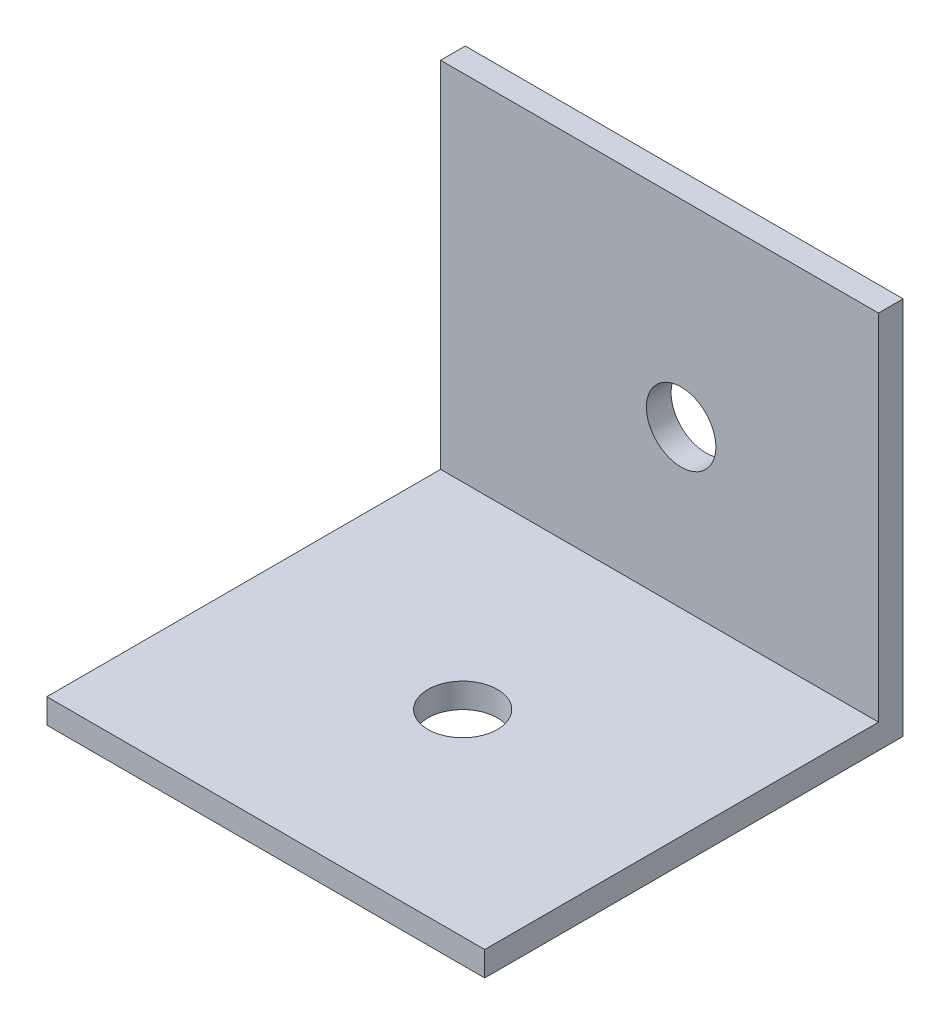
from build123d import *

# Parameters (mm, degrees)
SKETCH1_W           = 406.4
SKETCH1_H           = 24.384
BOSS_EXTRUDE1_DEPTH = 26.924
SKETCH2_W           = 406.4
SKETCH2_H           = 25.3365
CUT_EXTRUDE1_DEPTH  = 12.7
SKETCH3_W           = 406.4
SKETCH3_H           = 10.0965
CUT_EXTRUDE3_DEPTH  = 25.3365
SKETCH5_R           = 2.23393
CUT_EXTRUDE5_DEPTH  = 2.54
SKETCH6_W           = 409.302892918
SKETCH6_H           = 164.68100055
CUT_EXTRUDE6_DEPTH  = 65.024
SKETCH7_R           = 2.23393
CUT_EXTRUDE7_DEPTH  = 2.54


with BuildPart() as part:
    # Sketch1 → Boss-Extrude1 (new body)
    with BuildSketch(Plane.XY):
        with Locations((-6.626086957, 55.646509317)):
            Rectangle(SKETCH1_W, SKETCH1_H)
    extrude(amount=BOSS_EXTRUDE1_DEPTH)

    # Sketch2 → Cut-Extrude1 (cut)
    with BuildSketch(Plane(origin=(0, 67.838509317, 0), x_dir=(1, 0, 0), z_dir=(0, 1, 0))):
        with Locations((-6.626086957, -14.25575)):
            Rectangle(SKETCH2_W, SKETCH2_H)
    extrude(amount=-CUT_EXTRUDE1_DEPTH, mode=Mode.SUBTRACT)

    # Sketch3 → Cut-Extrude3 (cut)
    with BuildSketch(Plane.XY.offset(26.924)):
        with Locations((-6.626086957, 50.090259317)):
            Rectangle(SKETCH3_W, SKETCH3_H)
    extrude(amount=-CUT_EXTRUDE3_DEPTH, mode=Mode.SUBTRACT)

    # Sketch5 → Cut-Extrude5 (cut)
    with BuildSketch(Plane(origin=(0, 0, 0), x_dir=(-1, 0, 0), z_dir=(0, 0, -1))):
        with Locations((-183.873913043, 55.138509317)):
            Circle(SKETCH5_R)
        with Locations((197.126086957, 55.138509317)):
            Circle(SKETCH5_R)
    extrude(amount=-CUT_EXTRUDE5_DEPTH, mode=Mode.SUBTRACT)

    # Sketch6 → Cut-Extrude6 (cut)
    with BuildSketch(Plane.XZ.offset(-43.454509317)):
        with Locations((-36.252167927, -3.295077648)):
            Rectangle(SKETCH6_W, SKETCH6_H)
    extrude(amount=-CUT_EXTRUDE6_DEPTH, mode=Mode.SUBTRACT)

    # Sketch7 → Cut-Extrude7 (cut)
    with BuildSketch(Plane(origin=(0, 45.042009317, 0), x_dir=(1, 0, 0), z_dir=(0, 1, 0))):
        with Locations(Location((182.486595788, -14.25575, 0), (0, 0, 270))):
            Circle(SKETCH7_R)
    extrude(amount=-CUT_EXTRUDE7_DEPTH, mode=Mode.SUBTRACT)


solid = part.part
